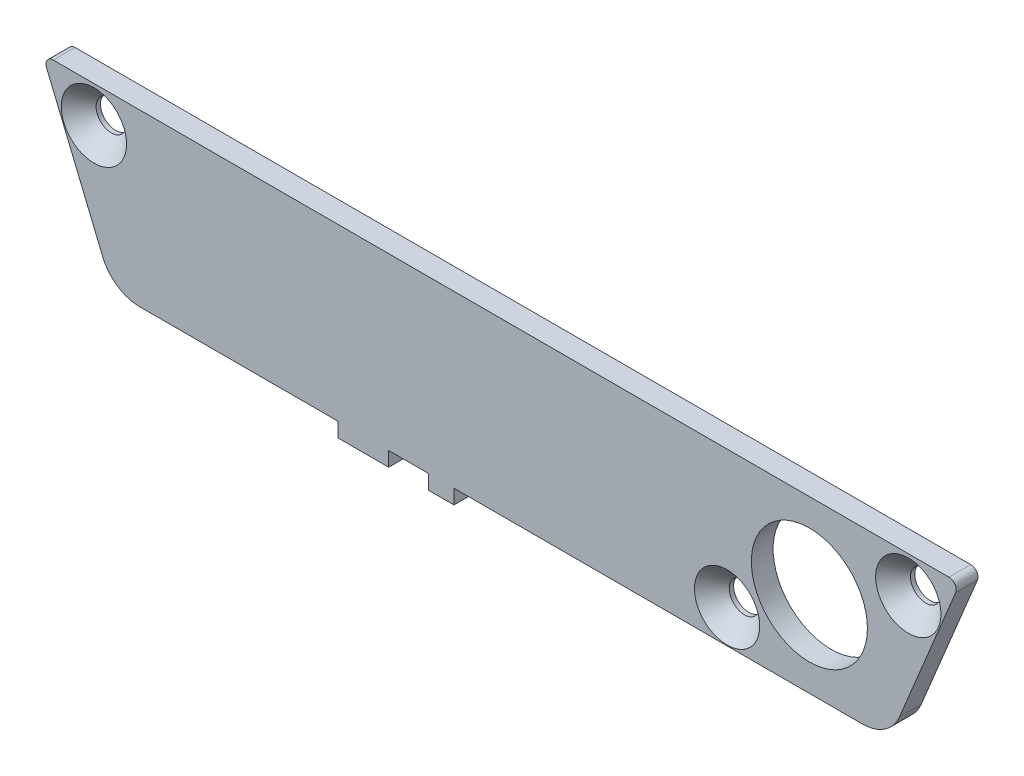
ISO-10303-21;
HEADER;
FILE_DESCRIPTION(('STEP AP214'),'2;1');
FILE_NAME('part.step','',(''),(''),'','','');
FILE_SCHEMA(('AUTOMOTIVE_DESIGN { 1 0 10303 214 1 1 1 1 }'));
ENDSEC;
DATA;
#1=APPLICATION_CONTEXT('core data for automotive mechanical design processes');
#2=APPLICATION_PROTOCOL_DEFINITION('international standard','automotive_design',2000,#1);
#3=PRODUCT_CONTEXT('',#1,'mechanical');
#4=PRODUCT('Part','Part','',(#3));
#5=PRODUCT_RELATED_PRODUCT_CATEGORY('part','',(#4));
#6=PRODUCT_DEFINITION_FORMATION('','',#4);
#7=PRODUCT_DEFINITION_CONTEXT('part definition',#1,'design');
#8=PRODUCT_DEFINITION('design','',#6,#7);
#9=PRODUCT_DEFINITION_SHAPE('','',#8);
#10=(LENGTH_UNIT() NAMED_UNIT(*) SI_UNIT(.MILLI.,.METRE.));
#11=(NAMED_UNIT(*) PLANE_ANGLE_UNIT() SI_UNIT($,.RADIAN.));
#12=(NAMED_UNIT(*) SI_UNIT($,.STERADIAN.) SOLID_ANGLE_UNIT());
#13=UNCERTAINTY_MEASURE_WITH_UNIT(LENGTH_MEASURE(1.E-05),#10,'distance_accuracy_value','');
#14=(GEOMETRIC_REPRESENTATION_CONTEXT(3) GLOBAL_UNCERTAINTY_ASSIGNED_CONTEXT((#13)) GLOBAL_UNIT_ASSIGNED_CONTEXT((#10,
#11,#12)) REPRESENTATION_CONTEXT('',''));
#15=CARTESIAN_POINT('',(0.,0.,0.));
#16=DIRECTION('',(0.,0.,1.));
#17=DIRECTION('',(1.,0.,0.));
#18=AXIS2_PLACEMENT_3D('',#15,#16,#17);
#19=CARTESIAN_POINT('',(130.529448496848,75.83614955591,131.349627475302));
#20=DIRECTION('',(0.,0.,1.));
#21=DIRECTION('',(1.,0.,0.));
#22=AXIS2_PLACEMENT_3D('',#19,#20,#21);
#23=CYLINDRICAL_SURFACE('',#22,0.999999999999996);
#24=CARTESIAN_POINT('',(130.529448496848,75.83614955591,134.349627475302));
#25=DIRECTION('',(0.,0.,1.));
#26=DIRECTION('',(1.,0.,0.));
#27=AXIS2_PLACEMENT_3D('',#24,#25,#26);
#28=CIRCLE('',#27,0.999999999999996);
#29=CARTESIAN_POINT('',(131.45332802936,75.4534661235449,134.349627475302));
#30=VERTEX_POINT('',#29);
#31=CARTESIAN_POINT('',(130.529448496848,76.83614955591,134.349627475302));
#32=VERTEX_POINT('',#31);
#33=EDGE_CURVE('E177',#30,#32,#28,.T.);
#34=ORIENTED_EDGE('',*,*,#33,.F.);
#35=DIRECTION('',(0.,0.,1.));
#36=VECTOR('',#35,1.);
#37=CARTESIAN_POINT('',(131.45332802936,75.4534661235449,131.349627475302));
#38=LINE('',#37,#36);
#39=CARTESIAN_POINT('',(131.45332802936,75.4534661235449,131.349627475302));
#40=VERTEX_POINT('',#39);
#41=EDGE_CURVE('E11',#40,#30,#38,.T.);
#42=ORIENTED_EDGE('',*,*,#41,.F.);
#43=CARTESIAN_POINT('',(130.529448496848,75.83614955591,131.349627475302));
#44=DIRECTION('',(0.,0.,1.));
#45=DIRECTION('',(1.,0.,0.));
#46=AXIS2_PLACEMENT_3D('',#43,#44,#45);
#47=CIRCLE('',#46,0.999999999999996);
#48=CARTESIAN_POINT('',(130.529448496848,76.83614955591,131.349627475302));
#49=VERTEX_POINT('',#48);
#50=EDGE_CURVE('E222',#40,#49,#47,.T.);
#51=ORIENTED_EDGE('',*,*,#50,.T.);
#52=DIRECTION('',(0.,0.,1.));
#53=VECTOR('',#52,1.);
#54=CARTESIAN_POINT('',(130.529448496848,76.83614955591,131.349627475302));
#55=LINE('',#54,#53);
#56=EDGE_CURVE('E35',#49,#32,#55,.T.);
#57=ORIENTED_EDGE('',*,*,#56,.T.);
#58=EDGE_LOOP('',(#34,#42,#51,#57));
#59=FACE_BOUND('',#58,.T.);
#60=ADVANCED_FACE('F32',(#59),#23,.T.);
#61=CARTESIAN_POINT('',(123.698390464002,56.7313906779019,131.349627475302));
#62=DIRECTION('',(0.923879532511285,-0.382683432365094,0.));
#63=DIRECTION('',(0.382683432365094,0.923879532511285,0.));
#64=AXIS2_PLACEMENT_3D('',#61,#62,#63);
#65=PLANE('',#64);
#66=DIRECTION('',(0.382683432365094,0.923879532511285,0.));
#67=VECTOR('',#66,1.);
#68=CARTESIAN_POINT('',(123.698390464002,56.7313906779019,134.349627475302));
#69=LINE('',#68,#67);
#70=CARTESIAN_POINT('',(123.698390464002,56.7313906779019,134.349627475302));
#71=VERTEX_POINT('',#70);
#72=EDGE_CURVE('E220',#71,#30,#69,.T.);
#73=ORIENTED_EDGE('',*,*,#72,.F.);
#74=DIRECTION('',(0.,0.,1.));
#75=VECTOR('',#74,1.);
#76=CARTESIAN_POINT('',(123.698390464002,56.7313906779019,131.349627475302));
#77=LINE('',#76,#75);
#78=CARTESIAN_POINT('',(123.698390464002,56.7313906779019,131.349627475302));
#79=VERTEX_POINT('',#78);
#80=EDGE_CURVE('E41',#79,#71,#77,.T.);
#81=ORIENTED_EDGE('',*,*,#80,.F.);
#82=DIRECTION('',(0.382683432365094,0.923879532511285,0.));
#83=VECTOR('',#82,1.);
#84=CARTESIAN_POINT('',(123.698390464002,56.7313906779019,131.349627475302));
#85=LINE('',#84,#83);
#86=EDGE_CURVE('E167',#79,#40,#85,.T.);
#87=ORIENTED_EDGE('',*,*,#86,.T.);
#88=ORIENTED_EDGE('',*,*,#41,.T.);
#89=EDGE_LOOP('',(#73,#81,#87,#88));
#90=FACE_BOUND('',#89,.T.);
#91=ADVANCED_FACE('F251',(#90),#65,.T.);
#92=CARTESIAN_POINT('',(118.61705303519,58.8361495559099,131.349627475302));
#93=DIRECTION('',(0.,0.,1.));
#94=DIRECTION('',(1.,0.,0.));
#95=AXIS2_PLACEMENT_3D('',#92,#93,#94);
#96=CYLINDRICAL_SURFACE('',#95,5.49999999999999);
#97=CARTESIAN_POINT('',(118.61705303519,58.8361495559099,134.349627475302));
#98=DIRECTION('',(0.,0.,1.));
#99=DIRECTION('',(1.,0.,0.));
#100=AXIS2_PLACEMENT_3D('',#97,#98,#99);
#101=CIRCLE('',#100,5.49999999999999);
#102=CARTESIAN_POINT('',(118.61705303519,53.33614955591,134.349627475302));
#103=VERTEX_POINT('',#102);
#104=EDGE_CURVE('E154',#103,#71,#101,.T.);
#105=ORIENTED_EDGE('',*,*,#104,.F.);
#106=DIRECTION('',(0.,0.,1.));
#107=VECTOR('',#106,1.);
#108=CARTESIAN_POINT('',(118.61705303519,53.33614955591,131.349627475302));
#109=LINE('',#108,#107);
#110=CARTESIAN_POINT('',(118.61705303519,53.33614955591,131.349627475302));
#111=VERTEX_POINT('',#110);
#112=EDGE_CURVE('E149',#111,#103,#109,.T.);
#113=ORIENTED_EDGE('',*,*,#112,.F.);
#114=CARTESIAN_POINT('',(118.61705303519,58.8361495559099,131.349627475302));
#115=DIRECTION('',(0.,0.,1.));
#116=DIRECTION('',(1.,0.,0.));
#117=AXIS2_PLACEMENT_3D('',#114,#115,#116);
#118=CIRCLE('',#117,5.49999999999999);
#119=EDGE_CURVE('E152',#111,#79,#118,.T.);
#120=ORIENTED_EDGE('',*,*,#119,.T.);
#121=ORIENTED_EDGE('',*,*,#80,.T.);
#122=EDGE_LOOP('',(#105,#113,#120,#121));
#123=FACE_BOUND('',#122,.T.);
#124=ADVANCED_FACE('F151',(#123),#96,.T.);
#125=CARTESIAN_POINT('',(62.2839844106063,53.33614955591,131.349627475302));
#126=DIRECTION('',(0.,-1.,0.));
#127=DIRECTION('',(0.,0.,-1.));
#128=AXIS2_PLACEMENT_3D('',#125,#126,#127);
#129=PLANE('',#128);
#130=DIRECTION('',(1.,0.,0.));
#131=VECTOR('',#130,1.);
#132=CARTESIAN_POINT('',(62.2839844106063,53.33614955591,134.349627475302));
#133=LINE('',#132,#131);
#134=CARTESIAN_POINT('',(62.2839844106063,53.33614955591,134.349627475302));
#135=VERTEX_POINT('',#134);
#136=EDGE_CURVE('E217',#135,#103,#133,.T.);
#137=ORIENTED_EDGE('',*,*,#136,.F.);
#138=DIRECTION('',(0.,0.,1.));
#139=VECTOR('',#138,1.);
#140=CARTESIAN_POINT('',(62.2839844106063,53.33614955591,131.349627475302));
#141=LINE('',#140,#139);
#142=CARTESIAN_POINT('',(62.2839844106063,53.33614955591,131.349627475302));
#143=VERTEX_POINT('',#142);
#144=EDGE_CURVE('E159',#143,#135,#141,.T.);
#145=ORIENTED_EDGE('',*,*,#144,.F.);
#146=DIRECTION('',(1.,0.,0.));
#147=VECTOR('',#146,1.);
#148=CARTESIAN_POINT('',(62.2839844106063,53.33614955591,131.349627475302));
#149=LINE('',#148,#147);
#150=EDGE_CURVE('E165',#143,#111,#149,.T.);
#151=ORIENTED_EDGE('',*,*,#150,.T.);
#152=ORIENTED_EDGE('',*,*,#112,.T.);
#153=EDGE_LOOP('',(#137,#145,#151,#152));
#154=FACE_BOUND('',#153,.T.);
#155=ADVANCED_FACE('F169',(#154),#129,.T.);
#156=CARTESIAN_POINT('',(62.2839844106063,53.33614955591,131.349627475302));
#157=DIRECTION('',(1.,0.,0.));
#158=DIRECTION('',(0.,0.,-1.));
#159=AXIS2_PLACEMENT_3D('',#156,#157,#158);
#160=PLANE('',#159);
#161=DIRECTION('',(0.,1.,0.));
#162=VECTOR('',#161,1.);
#163=CARTESIAN_POINT('',(62.2839844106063,53.33614955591,134.349627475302));
#164=LINE('',#163,#162);
#165=CARTESIAN_POINT('',(62.2839844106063,51.33614955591,134.349627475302));
#166=VERTEX_POINT('',#165);
#167=EDGE_CURVE('E214',#166,#135,#164,.T.);
#168=ORIENTED_EDGE('',*,*,#167,.F.);
#169=DIRECTION('',(0.,0.,1.));
#170=VECTOR('',#169,1.);
#171=CARTESIAN_POINT('',(62.2839844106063,51.33614955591,131.349627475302));
#172=LINE('',#171,#170);
#173=CARTESIAN_POINT('',(62.2839844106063,51.33614955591,131.349627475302));
#174=VERTEX_POINT('',#173);
#175=EDGE_CURVE('E226',#174,#166,#172,.T.);
#176=ORIENTED_EDGE('',*,*,#175,.F.);
#177=DIRECTION('',(0.,1.,0.));
#178=VECTOR('',#177,1.);
#179=CARTESIAN_POINT('',(62.2839844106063,53.33614955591,131.349627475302));
#180=LINE('',#179,#178);
#181=EDGE_CURVE('E170',#174,#143,#180,.T.);
#182=ORIENTED_EDGE('',*,*,#181,.T.);
#183=ORIENTED_EDGE('',*,*,#144,.T.);
#184=EDGE_LOOP('',(#168,#176,#182,#183));
#185=FACE_BOUND('',#184,.T.);
#186=ADVANCED_FACE('F264',(#185),#160,.T.);
#187=CARTESIAN_POINT('',(58.7839844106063,51.33614955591,131.349627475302));
#188=DIRECTION('',(0.,-1.,0.));
#189=DIRECTION('',(0.,0.,-1.));
#190=AXIS2_PLACEMENT_3D('',#187,#188,#189);
#191=PLANE('',#190);
#192=DIRECTION('',(1.,0.,0.));
#193=VECTOR('',#192,1.);
#194=CARTESIAN_POINT('',(58.7839844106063,51.33614955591,134.349627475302));
#195=LINE('',#194,#193);
#196=CARTESIAN_POINT('',(58.7839844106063,51.33614955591,134.349627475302));
#197=VERTEX_POINT('',#196);
#198=EDGE_CURVE('E211',#197,#166,#195,.T.);
#199=ORIENTED_EDGE('',*,*,#198,.F.);
#200=DIRECTION('',(0.,0.,1.));
#201=VECTOR('',#200,1.);
#202=CARTESIAN_POINT('',(58.7839844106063,51.33614955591,131.349627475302));
#203=LINE('',#202,#201);
#204=CARTESIAN_POINT('',(58.7839844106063,51.33614955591,131.349627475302));
#205=VERTEX_POINT('',#204);
#206=EDGE_CURVE('E228',#205,#197,#203,.T.);
#207=ORIENTED_EDGE('',*,*,#206,.F.);
#208=DIRECTION('',(1.,0.,0.));
#209=VECTOR('',#208,1.);
#210=CARTESIAN_POINT('',(58.7839844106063,51.33614955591,131.349627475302));
#211=LINE('',#210,#209);
#212=EDGE_CURVE('E172',#205,#174,#211,.T.);
#213=ORIENTED_EDGE('',*,*,#212,.T.);
#214=ORIENTED_EDGE('',*,*,#175,.T.);
#215=EDGE_LOOP('',(#199,#207,#213,#214));
#216=FACE_BOUND('',#215,.T.);
#217=ADVANCED_FACE('F267',(#216),#191,.T.);
#218=CARTESIAN_POINT('',(58.7839844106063,53.33614955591,131.349627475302));
#219=DIRECTION('',(-1.,0.,0.));
#220=DIRECTION('',(0.,-1.,0.));
#221=AXIS2_PLACEMENT_3D('',#218,#219,#220);
#222=PLANE('',#221);
#223=DIRECTION('',(0.,-1.,0.));
#224=VECTOR('',#223,1.);
#225=CARTESIAN_POINT('',(58.7839844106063,53.33614955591,134.349627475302));
#226=LINE('',#225,#224);
#227=CARTESIAN_POINT('',(58.7839844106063,53.33614955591,134.349627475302));
#228=VERTEX_POINT('',#227);
#229=EDGE_CURVE('E208',#228,#197,#226,.T.);
#230=ORIENTED_EDGE('',*,*,#229,.F.);
#231=DIRECTION('',(0.,0.,1.));
#232=VECTOR('',#231,1.);
#233=CARTESIAN_POINT('',(58.7839844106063,53.33614955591,131.349627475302));
#234=LINE('',#233,#232);
#235=CARTESIAN_POINT('',(58.7839844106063,53.33614955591,131.349627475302));
#236=VERTEX_POINT('',#235);
#237=EDGE_CURVE('E230',#236,#228,#234,.T.);
#238=ORIENTED_EDGE('',*,*,#237,.F.);
#239=DIRECTION('',(0.,-1.,0.));
#240=VECTOR('',#239,1.);
#241=CARTESIAN_POINT('',(58.7839844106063,53.33614955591,131.349627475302));
#242=LINE('',#241,#240);
#243=EDGE_CURVE('E409',#236,#205,#242,.T.);
#244=ORIENTED_EDGE('',*,*,#243,.T.);
#245=ORIENTED_EDGE('',*,*,#206,.T.);
#246=EDGE_LOOP('',(#230,#238,#244,#245));
#247=FACE_BOUND('',#246,.T.);
#248=ADVANCED_FACE('F271',(#247),#222,.T.);
#249=CARTESIAN_POINT('',(53.2839844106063,53.33614955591,131.349627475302));
#250=DIRECTION('',(0.,-1.,0.));
#251=DIRECTION('',(0.,0.,-1.));
#252=AXIS2_PLACEMENT_3D('',#249,#250,#251);
#253=PLANE('',#252);
#254=DIRECTION('',(1.,0.,0.));
#255=VECTOR('',#254,1.);
#256=CARTESIAN_POINT('',(53.2839844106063,53.33614955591,134.349627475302));
#257=LINE('',#256,#255);
#258=CARTESIAN_POINT('',(53.2839844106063,53.33614955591,134.349627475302));
#259=VERTEX_POINT('',#258);
#260=EDGE_CURVE('E205',#259,#228,#257,.T.);
#261=ORIENTED_EDGE('',*,*,#260,.F.);
#262=DIRECTION('',(0.,0.,1.));
#263=VECTOR('',#262,1.);
#264=CARTESIAN_POINT('',(53.2839844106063,53.33614955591,131.349627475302));
#265=LINE('',#264,#263);
#266=CARTESIAN_POINT('',(53.2839844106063,53.33614955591,131.349627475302));
#267=VERTEX_POINT('',#266);
#268=EDGE_CURVE('E232',#267,#259,#265,.T.);
#269=ORIENTED_EDGE('',*,*,#268,.F.);
#270=DIRECTION('',(1.,0.,0.));
#271=VECTOR('',#270,1.);
#272=CARTESIAN_POINT('',(53.2839844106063,53.33614955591,131.349627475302));
#273=LINE('',#272,#271);
#274=EDGE_CURVE('E406',#267,#236,#273,.T.);
#275=ORIENTED_EDGE('',*,*,#274,.T.);
#276=ORIENTED_EDGE('',*,*,#237,.T.);
#277=EDGE_LOOP('',(#261,#269,#275,#276));
#278=FACE_BOUND('',#277,.T.);
#279=ADVANCED_FACE('F275',(#278),#253,.T.);
#280=CARTESIAN_POINT('',(53.2839844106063,51.33614955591,131.349627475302));
#281=DIRECTION('',(1.,0.,0.));
#282=DIRECTION('',(0.,0.,-1.));
#283=AXIS2_PLACEMENT_3D('',#280,#281,#282);
#284=PLANE('',#283);
#285=DIRECTION('',(0.,1.,0.));
#286=VECTOR('',#285,1.);
#287=CARTESIAN_POINT('',(53.2839844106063,51.33614955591,134.349627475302));
#288=LINE('',#287,#286);
#289=CARTESIAN_POINT('',(53.2839844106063,51.33614955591,134.349627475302));
#290=VERTEX_POINT('',#289);
#291=EDGE_CURVE('E202',#290,#259,#288,.T.);
#292=ORIENTED_EDGE('',*,*,#291,.F.);
#293=DIRECTION('',(0.,0.,1.));
#294=VECTOR('',#293,1.);
#295=CARTESIAN_POINT('',(53.2839844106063,51.33614955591,131.349627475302));
#296=LINE('',#295,#294);
#297=CARTESIAN_POINT('',(53.2839844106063,51.33614955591,131.349627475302));
#298=VERTEX_POINT('',#297);
#299=EDGE_CURVE('E234',#298,#290,#296,.T.);
#300=ORIENTED_EDGE('',*,*,#299,.F.);
#301=DIRECTION('',(0.,1.,0.));
#302=VECTOR('',#301,1.);
#303=CARTESIAN_POINT('',(53.2839844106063,51.33614955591,131.349627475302));
#304=LINE('',#303,#302);
#305=EDGE_CURVE('E403',#298,#267,#304,.T.);
#306=ORIENTED_EDGE('',*,*,#305,.T.);
#307=ORIENTED_EDGE('',*,*,#268,.T.);
#308=EDGE_LOOP('',(#292,#300,#306,#307));
#309=FACE_BOUND('',#308,.T.);
#310=ADVANCED_FACE('F279',(#309),#284,.T.);
#311=CARTESIAN_POINT('',(46.2839844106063,51.33614955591,131.349627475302));
#312=DIRECTION('',(0.,-1.,0.));
#313=DIRECTION('',(0.,0.,-1.));
#314=AXIS2_PLACEMENT_3D('',#311,#312,#313);
#315=PLANE('',#314);
#316=DIRECTION('',(1.,0.,0.));
#317=VECTOR('',#316,1.);
#318=CARTESIAN_POINT('',(46.2839844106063,51.33614955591,134.349627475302));
#319=LINE('',#318,#317);
#320=CARTESIAN_POINT('',(46.2839844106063,51.33614955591,134.349627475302));
#321=VERTEX_POINT('',#320);
#322=EDGE_CURVE('E199',#321,#290,#319,.T.);
#323=ORIENTED_EDGE('',*,*,#322,.F.);
#324=DIRECTION('',(0.,0.,1.));
#325=VECTOR('',#324,1.);
#326=CARTESIAN_POINT('',(46.2839844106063,51.33614955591,131.349627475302));
#327=LINE('',#326,#325);
#328=CARTESIAN_POINT('',(46.2839844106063,51.33614955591,131.349627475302));
#329=VERTEX_POINT('',#328);
#330=EDGE_CURVE('E236',#329,#321,#327,.T.);
#331=ORIENTED_EDGE('',*,*,#330,.F.);
#332=DIRECTION('',(1.,0.,0.));
#333=VECTOR('',#332,1.);
#334=CARTESIAN_POINT('',(46.2839844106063,51.33614955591,131.349627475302));
#335=LINE('',#334,#333);
#336=EDGE_CURVE('E400',#329,#298,#335,.T.);
#337=ORIENTED_EDGE('',*,*,#336,.T.);
#338=ORIENTED_EDGE('',*,*,#299,.T.);
#339=EDGE_LOOP('',(#323,#331,#337,#338));
#340=FACE_BOUND('',#339,.T.);
#341=ADVANCED_FACE('F283',(#340),#315,.T.);
#342=CARTESIAN_POINT('',(46.2839844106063,53.33614955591,131.349627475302));
#343=DIRECTION('',(-1.,0.,0.));
#344=DIRECTION('',(0.,0.,1.));
#345=AXIS2_PLACEMENT_3D('',#342,#343,#344);
#346=PLANE('',#345);
#347=DIRECTION('',(0.,-1.,0.));
#348=VECTOR('',#347,1.);
#349=CARTESIAN_POINT('',(46.2839844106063,53.33614955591,134.349627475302));
#350=LINE('',#349,#348);
#351=CARTESIAN_POINT('',(46.2839844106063,53.33614955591,134.349627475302));
#352=VERTEX_POINT('',#351);
#353=EDGE_CURVE('E196',#352,#321,#350,.T.);
#354=ORIENTED_EDGE('',*,*,#353,.F.);
#355=DIRECTION('',(0.,0.,1.));
#356=VECTOR('',#355,1.);
#357=CARTESIAN_POINT('',(46.2839844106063,53.33614955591,131.349627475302));
#358=LINE('',#357,#356);
#359=CARTESIAN_POINT('',(46.2839844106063,53.33614955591,131.349627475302));
#360=VERTEX_POINT('',#359);
#361=EDGE_CURVE('E238',#360,#352,#358,.T.);
#362=ORIENTED_EDGE('',*,*,#361,.F.);
#363=DIRECTION('',(0.,-1.,0.));
#364=VECTOR('',#363,1.);
#365=CARTESIAN_POINT('',(46.2839844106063,53.33614955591,131.349627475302));
#366=LINE('',#365,#364);
#367=EDGE_CURVE('E397',#360,#329,#366,.T.);
#368=ORIENTED_EDGE('',*,*,#367,.T.);
#369=ORIENTED_EDGE('',*,*,#330,.T.);
#370=EDGE_LOOP('',(#354,#362,#368,#369));
#371=FACE_BOUND('',#370,.T.);
#372=ADVANCED_FACE('F287',(#371),#346,.T.);
#373=CARTESIAN_POINT('',(18.9509157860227,53.33614955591,131.349627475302));
#374=DIRECTION('',(0.,-1.,0.));
#375=DIRECTION('',(0.,0.,-1.));
#376=AXIS2_PLACEMENT_3D('',#373,#374,#375);
#377=PLANE('',#376);
#378=DIRECTION('',(1.,0.,0.));
#379=VECTOR('',#378,1.);
#380=CARTESIAN_POINT('',(18.9509157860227,53.33614955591,134.349627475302));
#381=LINE('',#380,#379);
#382=CARTESIAN_POINT('',(18.9509157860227,53.33614955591,134.349627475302));
#383=VERTEX_POINT('',#382);
#384=EDGE_CURVE('E193',#383,#352,#381,.T.);
#385=ORIENTED_EDGE('',*,*,#384,.F.);
#386=DIRECTION('',(0.,0.,1.));
#387=VECTOR('',#386,1.);
#388=CARTESIAN_POINT('',(18.9509157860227,53.33614955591,131.349627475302));
#389=LINE('',#388,#387);
#390=CARTESIAN_POINT('',(18.9509157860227,53.33614955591,131.349627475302));
#391=VERTEX_POINT('',#390);
#392=EDGE_CURVE('E240',#391,#383,#389,.T.);
#393=ORIENTED_EDGE('',*,*,#392,.F.);
#394=DIRECTION('',(1.,0.,0.));
#395=VECTOR('',#394,1.);
#396=CARTESIAN_POINT('',(18.9509157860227,53.33614955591,131.349627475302));
#397=LINE('',#396,#395);
#398=EDGE_CURVE('E394',#391,#360,#397,.T.);
#399=ORIENTED_EDGE('',*,*,#398,.T.);
#400=ORIENTED_EDGE('',*,*,#361,.T.);
#401=EDGE_LOOP('',(#385,#393,#399,#400));
#402=FACE_BOUND('',#401,.T.);
#403=ADVANCED_FACE('F291',(#402),#377,.T.);
#404=CARTESIAN_POINT('',(18.9509157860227,58.8361495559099,131.349627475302));
#405=DIRECTION('',(0.,0.,1.));
#406=DIRECTION('',(1.,0.,0.));
#407=AXIS2_PLACEMENT_3D('',#404,#405,#406);
#408=CYLINDRICAL_SURFACE('',#407,5.49999999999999);
#409=CARTESIAN_POINT('',(18.9509157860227,58.8361495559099,134.349627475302));
#410=DIRECTION('',(0.,0.,1.));
#411=DIRECTION('',(1.,0.,0.));
#412=AXIS2_PLACEMENT_3D('',#409,#410,#411);
#413=CIRCLE('',#412,5.49999999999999);
#414=CARTESIAN_POINT('',(13.8695783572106,56.7313906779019,134.349627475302));
#415=VERTEX_POINT('',#414);
#416=EDGE_CURVE('E190',#415,#383,#413,.T.);
#417=ORIENTED_EDGE('',*,*,#416,.F.);
#418=DIRECTION('',(0.,0.,1.));
#419=VECTOR('',#418,1.);
#420=CARTESIAN_POINT('',(13.8695783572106,56.7313906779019,131.349627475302));
#421=LINE('',#420,#419);
#422=CARTESIAN_POINT('',(13.8695783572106,56.7313906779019,131.349627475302));
#423=VERTEX_POINT('',#422);
#424=EDGE_CURVE('E242',#423,#415,#421,.T.);
#425=ORIENTED_EDGE('',*,*,#424,.F.);
#426=CARTESIAN_POINT('',(18.9509157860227,58.8361495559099,131.349627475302));
#427=DIRECTION('',(0.,0.,1.));
#428=DIRECTION('',(1.,0.,0.));
#429=AXIS2_PLACEMENT_3D('',#426,#427,#428);
#430=CIRCLE('',#429,5.49999999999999);
#431=EDGE_CURVE('E392',#423,#391,#430,.T.);
#432=ORIENTED_EDGE('',*,*,#431,.T.);
#433=ORIENTED_EDGE('',*,*,#392,.T.);
#434=EDGE_LOOP('',(#417,#425,#432,#433));
#435=FACE_BOUND('',#434,.T.);
#436=ADVANCED_FACE('F295',(#435),#408,.T.);
#437=CARTESIAN_POINT('',(6.11464079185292,75.4534661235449,131.349627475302));
#438=DIRECTION('',(-0.923879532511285,-0.382683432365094,0.));
#439=DIRECTION('',(0.382683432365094,-0.923879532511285,0.));
#440=AXIS2_PLACEMENT_3D('',#437,#438,#439);
#441=PLANE('',#440);
#442=DIRECTION('',(0.382683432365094,-0.923879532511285,0.));
#443=VECTOR('',#442,1.);
#444=CARTESIAN_POINT('',(6.11464079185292,75.4534661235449,134.349627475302));
#445=LINE('',#444,#443);
#446=CARTESIAN_POINT('',(6.11464079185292,75.4534661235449,134.349627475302));
#447=VERTEX_POINT('',#446);
#448=EDGE_CURVE('E187',#447,#415,#445,.T.);
#449=ORIENTED_EDGE('',*,*,#448,.F.);
#450=DIRECTION('',(0.,0.,1.));
#451=VECTOR('',#450,1.);
#452=CARTESIAN_POINT('',(6.11464079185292,75.4534661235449,131.349627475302));
#453=LINE('',#452,#451);
#454=CARTESIAN_POINT('',(6.11464079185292,75.4534661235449,131.349627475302));
#455=VERTEX_POINT('',#454);
#456=EDGE_CURVE('E245',#455,#447,#453,.T.);
#457=ORIENTED_EDGE('',*,*,#456,.F.);
#458=DIRECTION('',(0.382683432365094,-0.923879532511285,0.));
#459=VECTOR('',#458,1.);
#460=CARTESIAN_POINT('',(6.11464079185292,75.4534661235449,131.349627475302));
#461=LINE('',#460,#459);
#462=EDGE_CURVE('E389',#455,#423,#461,.T.);
#463=ORIENTED_EDGE('',*,*,#462,.T.);
#464=ORIENTED_EDGE('',*,*,#424,.T.);
#465=EDGE_LOOP('',(#449,#457,#463,#464));
#466=FACE_BOUND('',#465,.T.);
#467=ADVANCED_FACE('F299',(#466),#441,.T.);
#468=CARTESIAN_POINT('',(7.03852032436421,75.83614955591,131.349627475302));
#469=DIRECTION('',(0.,0.,1.));
#470=DIRECTION('',(1.,0.,0.));
#471=AXIS2_PLACEMENT_3D('',#468,#469,#470);
#472=CYLINDRICAL_SURFACE('',#471,1.);
#473=CARTESIAN_POINT('',(7.03852032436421,75.83614955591,134.349627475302));
#474=DIRECTION('',(0.,0.,1.));
#475=DIRECTION('',(1.,0.,0.));
#476=AXIS2_PLACEMENT_3D('',#473,#474,#475);
#477=CIRCLE('',#476,1.);
#478=CARTESIAN_POINT('',(7.03852032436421,76.83614955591,134.349627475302));
#479=VERTEX_POINT('',#478);
#480=EDGE_CURVE('E184',#479,#447,#477,.T.);
#481=ORIENTED_EDGE('',*,*,#480,.F.);
#482=DIRECTION('',(0.,0.,1.));
#483=VECTOR('',#482,1.);
#484=CARTESIAN_POINT('',(7.03852032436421,76.83614955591,131.349627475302));
#485=LINE('',#484,#483);
#486=CARTESIAN_POINT('',(7.03852032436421,76.83614955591,131.349627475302));
#487=VERTEX_POINT('',#486);
#488=EDGE_CURVE('E246',#487,#479,#485,.T.);
#489=ORIENTED_EDGE('',*,*,#488,.F.);
#490=CARTESIAN_POINT('',(7.03852032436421,75.83614955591,131.349627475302));
#491=DIRECTION('',(0.,0.,1.));
#492=DIRECTION('',(1.,0.,0.));
#493=AXIS2_PLACEMENT_3D('',#490,#491,#492);
#494=CIRCLE('',#493,1.);
#495=EDGE_CURVE('E386',#487,#455,#494,.T.);
#496=ORIENTED_EDGE('',*,*,#495,.T.);
#497=ORIENTED_EDGE('',*,*,#456,.T.);
#498=EDGE_LOOP('',(#481,#489,#496,#497));
#499=FACE_BOUND('',#498,.T.);
#500=ADVANCED_FACE('F303',(#499),#472,.T.);
#501=CARTESIAN_POINT('',(130.529448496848,76.83614955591,131.349627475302));
#502=DIRECTION('',(0.,1.,0.));
#503=DIRECTION('',(0.,0.,1.));
#504=AXIS2_PLACEMENT_3D('',#501,#502,#503);
#505=PLANE('',#504);
#506=DIRECTION('',(-1.,0.,0.));
#507=VECTOR('',#506,1.);
#508=CARTESIAN_POINT('',(130.529448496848,76.83614955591,134.349627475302));
#509=LINE('',#508,#507);
#510=EDGE_CURVE('E180',#32,#479,#509,.T.);
#511=ORIENTED_EDGE('',*,*,#510,.F.);
#512=ORIENTED_EDGE('',*,*,#56,.F.);
#513=DIRECTION('',(-1.,0.,0.));
#514=VECTOR('',#513,1.);
#515=CARTESIAN_POINT('',(130.529448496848,76.83614955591,131.349627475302));
#516=LINE('',#515,#514);
#517=EDGE_CURVE('E384',#49,#487,#516,.T.);
#518=ORIENTED_EDGE('',*,*,#517,.T.);
#519=ORIENTED_EDGE('',*,*,#488,.T.);
#520=EDGE_LOOP('',(#511,#512,#518,#519));
#521=FACE_BOUND('',#520,.T.);
#522=ADVANCED_FACE('F248',(#521),#505,.T.);
#523=CARTESIAN_POINT('',(130.529448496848,75.83614955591,131.349627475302));
#524=DIRECTION('',(0.,0.,1.));
#525=DIRECTION('',(1.,0.,0.));
#526=AXIS2_PLACEMENT_3D('',#523,#524,#525);
#527=PLANE('',#526);
#528=CARTESIAN_POINT('',(111.283984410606,65.08614955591,131.349627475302));
#529=DIRECTION('',(0.,0.,1.));
#530=DIRECTION('',(1.,0.,0.));
#531=AXIS2_PLACEMENT_3D('',#528,#529,#530);
#532=CIRCLE('',#531,8.00000000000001);
#533=CARTESIAN_POINT('',(119.283984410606,65.08614955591,131.349627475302));
#534=VERTEX_POINT('',#533);
#535=EDGE_CURVE('E353',#534,#534,#532,.F.);
#536=ORIENTED_EDGE('',*,*,#535,.F.);
#537=EDGE_LOOP('',(#536));
#538=FACE_BOUND('',#537,.T.);
#539=CARTESIAN_POINT('',(12.6461061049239,71.8361495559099,131.349627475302));
#540=DIRECTION('',(0.,0.,1.));
#541=DIRECTION('',(1.,0.,0.));
#542=AXIS2_PLACEMENT_3D('',#539,#540,#541);
#543=CIRCLE('',#542,2.1);
#544=CARTESIAN_POINT('',(14.7461061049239,71.8361495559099,131.349627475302));
#545=VERTEX_POINT('',#544);
#546=EDGE_CURVE('E363',#545,#545,#543,.T.);
#547=ORIENTED_EDGE('',*,*,#546,.T.);
#548=EDGE_LOOP('',(#547));
#549=FACE_BOUND('',#548,.T.);
#550=CARTESIAN_POINT('',(99.9339844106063,57.93614955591,131.349627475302));
#551=DIRECTION('',(0.,0.,1.));
#552=DIRECTION('',(1.,0.,0.));
#553=AXIS2_PLACEMENT_3D('',#550,#551,#552);
#554=CIRCLE('',#553,2.1);
#555=CARTESIAN_POINT('',(102.033984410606,57.93614955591,131.349627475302));
#556=VERTEX_POINT('',#555);
#557=EDGE_CURVE('E372',#556,#556,#554,.T.);
#558=ORIENTED_EDGE('',*,*,#557,.T.);
#559=EDGE_LOOP('',(#558));
#560=FACE_BOUND('',#559,.T.);
#561=CARTESIAN_POINT('',(124.921862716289,71.8361495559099,131.349627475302));
#562=DIRECTION('',(0.,0.,1.));
#563=DIRECTION('',(1.,0.,0.));
#564=AXIS2_PLACEMENT_3D('',#561,#562,#563);
#565=CIRCLE('',#564,2.09999999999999);
#566=CARTESIAN_POINT('',(127.021862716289,71.8361495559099,131.349627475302));
#567=VERTEX_POINT('',#566);
#568=EDGE_CURVE('E181',#567,#567,#565,.T.);
#569=ORIENTED_EDGE('',*,*,#568,.T.);
#570=EDGE_LOOP('',(#569));
#571=FACE_BOUND('',#570,.T.);
#572=ORIENTED_EDGE('',*,*,#50,.F.);
#573=ORIENTED_EDGE('',*,*,#86,.F.);
#574=ORIENTED_EDGE('',*,*,#119,.F.);
#575=ORIENTED_EDGE('',*,*,#150,.F.);
#576=ORIENTED_EDGE('',*,*,#181,.F.);
#577=ORIENTED_EDGE('',*,*,#212,.F.);
#578=ORIENTED_EDGE('',*,*,#243,.F.);
#579=ORIENTED_EDGE('',*,*,#274,.F.);
#580=ORIENTED_EDGE('',*,*,#305,.F.);
#581=ORIENTED_EDGE('',*,*,#336,.F.);
#582=ORIENTED_EDGE('',*,*,#367,.F.);
#583=ORIENTED_EDGE('',*,*,#398,.F.);
#584=ORIENTED_EDGE('',*,*,#431,.F.);
#585=ORIENTED_EDGE('',*,*,#462,.F.);
#586=ORIENTED_EDGE('',*,*,#495,.F.);
#587=ORIENTED_EDGE('',*,*,#517,.F.);
#588=EDGE_LOOP('',(#572,#573,#574,#575,#576,#577,#578,#579,#580,#581,#582,#583,#584,#585,#586,#587));
#589=FACE_BOUND('',#588,.T.);
#590=ADVANCED_FACE('F163',(#538,#549,#560,#571,#589),#527,.F.);
#591=CARTESIAN_POINT('',(130.529448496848,75.83614955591,134.349627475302));
#592=DIRECTION('',(0.,0.,1.));
#593=DIRECTION('',(1.,0.,0.));
#594=AXIS2_PLACEMENT_3D('',#591,#592,#593);
#595=PLANE('',#594);
#596=CARTESIAN_POINT('',(111.283984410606,65.08614955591,134.349627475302));
#597=DIRECTION('',(0.,0.,1.));
#598=DIRECTION('',(1.,0.,0.));
#599=AXIS2_PLACEMENT_3D('',#596,#597,#598);
#600=CIRCLE('',#599,8.00000000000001);
#601=CARTESIAN_POINT('',(119.283984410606,65.08614955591,134.349627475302));
#602=VERTEX_POINT('',#601);
#603=EDGE_CURVE('E351',#602,#602,#600,.T.);
#604=ORIENTED_EDGE('',*,*,#603,.F.);
#605=EDGE_LOOP('',(#604));
#606=FACE_BOUND('',#605,.T.);
#607=CARTESIAN_POINT('',(12.6461061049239,71.8361495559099,134.349627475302));
#608=DIRECTION('',(0.,0.,1.));
#609=DIRECTION('',(1.,0.,0.));
#610=AXIS2_PLACEMENT_3D('',#607,#608,#609);
#611=CIRCLE('',#610,4.5);
#612=CARTESIAN_POINT('',(17.1461061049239,71.8361495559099,134.349627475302));
#613=VERTEX_POINT('',#612);
#614=EDGE_CURVE('E354',#613,#613,#611,.T.);
#615=ORIENTED_EDGE('',*,*,#614,.F.);
#616=EDGE_LOOP('',(#615));
#617=FACE_BOUND('',#616,.T.);
#618=CARTESIAN_POINT('',(99.9339844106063,57.93614955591,134.349627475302));
#619=DIRECTION('',(0.,0.,1.));
#620=DIRECTION('',(1.,0.,0.));
#621=AXIS2_PLACEMENT_3D('',#618,#619,#620);
#622=CIRCLE('',#621,4.5);
#623=CARTESIAN_POINT('',(104.433984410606,57.93614955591,134.349627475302));
#624=VERTEX_POINT('',#623);
#625=EDGE_CURVE('E366',#624,#624,#622,.T.);
#626=ORIENTED_EDGE('',*,*,#625,.F.);
#627=EDGE_LOOP('',(#626));
#628=FACE_BOUND('',#627,.T.);
#629=CARTESIAN_POINT('',(124.921862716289,71.8361495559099,134.349627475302));
#630=DIRECTION('',(0.,0.,1.));
#631=DIRECTION('',(1.,0.,0.));
#632=AXIS2_PLACEMENT_3D('',#629,#630,#631);
#633=CIRCLE('',#632,4.5);
#634=CARTESIAN_POINT('',(129.421862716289,71.8361495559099,134.349627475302));
#635=VERTEX_POINT('',#634);
#636=EDGE_CURVE('E375',#635,#635,#633,.T.);
#637=ORIENTED_EDGE('',*,*,#636,.F.);
#638=EDGE_LOOP('',(#637));
#639=FACE_BOUND('',#638,.T.);
#640=ORIENTED_EDGE('',*,*,#33,.T.);
#641=ORIENTED_EDGE('',*,*,#510,.T.);
#642=ORIENTED_EDGE('',*,*,#480,.T.);
#643=ORIENTED_EDGE('',*,*,#448,.T.);
#644=ORIENTED_EDGE('',*,*,#416,.T.);
#645=ORIENTED_EDGE('',*,*,#384,.T.);
#646=ORIENTED_EDGE('',*,*,#353,.T.);
#647=ORIENTED_EDGE('',*,*,#322,.T.);
#648=ORIENTED_EDGE('',*,*,#291,.T.);
#649=ORIENTED_EDGE('',*,*,#260,.T.);
#650=ORIENTED_EDGE('',*,*,#229,.T.);
#651=ORIENTED_EDGE('',*,*,#198,.T.);
#652=ORIENTED_EDGE('',*,*,#167,.T.);
#653=ORIENTED_EDGE('',*,*,#136,.T.);
#654=ORIENTED_EDGE('',*,*,#104,.T.);
#655=ORIENTED_EDGE('',*,*,#72,.T.);
#656=EDGE_LOOP('',(#640,#641,#642,#643,#644,#645,#646,#647,#648,#649,#650,#651,#652,#653,#654,#655));
#657=FACE_BOUND('',#656,.T.);
#658=ADVANCED_FACE('F250',(#606,#617,#628,#639,#657),#595,.T.);
#659=CARTESIAN_POINT('',(124.921862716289,71.8361495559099,134.349627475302));
#660=DIRECTION('',(0.,0.,1.));
#661=DIRECTION('',(1.,0.,0.));
#662=AXIS2_PLACEMENT_3D('',#659,#660,#661);
#663=CYLINDRICAL_SURFACE('',#662,2.09999999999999);
#664=ORIENTED_EDGE('',*,*,#568,.F.);
#665=EDGE_LOOP('',(#664));
#666=FACE_BOUND('',#665,.T.);
#667=CARTESIAN_POINT('',(124.921862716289,71.8361495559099,131.949627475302));
#668=DIRECTION('',(0.,0.,1.));
#669=DIRECTION('',(1.,0.,0.));
#670=AXIS2_PLACEMENT_3D('',#667,#668,#669);
#671=CIRCLE('',#670,2.09999999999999);
#672=CARTESIAN_POINT('',(127.021862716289,71.8361495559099,131.949627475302));
#673=VERTEX_POINT('',#672);
#674=EDGE_CURVE('E378',#673,#673,#671,.T.);
#675=ORIENTED_EDGE('',*,*,#674,.T.);
#676=EDGE_LOOP('',(#675));
#677=FACE_BOUND('',#676,.T.);
#678=ADVANCED_FACE('F315',(#666,#677),#663,.F.);
#679=CARTESIAN_POINT('',(124.921862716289,71.8361495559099,134.349627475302));
#680=DIRECTION('',(0.,0.,1.));
#681=DIRECTION('',(1.,0.,0.));
#682=AXIS2_PLACEMENT_3D('',#679,#680,#681);
#683=CONICAL_SURFACE('',#682,4.5,0.785398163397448);
#684=ORIENTED_EDGE('',*,*,#674,.F.);
#685=EDGE_LOOP('',(#684));
#686=FACE_BOUND('',#685,.T.);
#687=ORIENTED_EDGE('',*,*,#636,.T.);
#688=EDGE_LOOP('',(#687));
#689=FACE_BOUND('',#688,.T.);
#690=ADVANCED_FACE('F322',(#686,#689),#683,.F.);
#691=CARTESIAN_POINT('',(99.9339844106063,57.93614955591,134.349627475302));
#692=DIRECTION('',(0.,0.,1.));
#693=DIRECTION('',(1.,0.,0.));
#694=AXIS2_PLACEMENT_3D('',#691,#692,#693);
#695=CYLINDRICAL_SURFACE('',#694,2.1);
#696=ORIENTED_EDGE('',*,*,#557,.F.);
#697=EDGE_LOOP('',(#696));
#698=FACE_BOUND('',#697,.T.);
#699=CARTESIAN_POINT('',(99.9339844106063,57.93614955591,131.949627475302));
#700=DIRECTION('',(0.,0.,1.));
#701=DIRECTION('',(1.,0.,0.));
#702=AXIS2_PLACEMENT_3D('',#699,#700,#701);
#703=CIRCLE('',#702,2.1);
#704=CARTESIAN_POINT('',(102.033984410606,57.93614955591,131.949627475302));
#705=VERTEX_POINT('',#704);
#706=EDGE_CURVE('E369',#705,#705,#703,.T.);
#707=ORIENTED_EDGE('',*,*,#706,.T.);
#708=EDGE_LOOP('',(#707));
#709=FACE_BOUND('',#708,.T.);
#710=ADVANCED_FACE('F326',(#698,#709),#695,.F.);
#711=CARTESIAN_POINT('',(99.9339844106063,57.93614955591,134.349627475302));
#712=DIRECTION('',(0.,0.,1.));
#713=DIRECTION('',(1.,0.,0.));
#714=AXIS2_PLACEMENT_3D('',#711,#712,#713);
#715=CONICAL_SURFACE('',#714,4.5,0.785398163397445);
#716=ORIENTED_EDGE('',*,*,#706,.F.);
#717=EDGE_LOOP('',(#716));
#718=FACE_BOUND('',#717,.T.);
#719=ORIENTED_EDGE('',*,*,#625,.T.);
#720=EDGE_LOOP('',(#719));
#721=FACE_BOUND('',#720,.T.);
#722=ADVANCED_FACE('F330',(#718,#721),#715,.F.);
#723=CARTESIAN_POINT('',(12.6461061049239,71.8361495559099,134.349627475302));
#724=DIRECTION('',(0.,0.,1.));
#725=DIRECTION('',(1.,0.,0.));
#726=AXIS2_PLACEMENT_3D('',#723,#724,#725);
#727=CYLINDRICAL_SURFACE('',#726,2.1);
#728=ORIENTED_EDGE('',*,*,#546,.F.);
#729=EDGE_LOOP('',(#728));
#730=FACE_BOUND('',#729,.T.);
#731=CARTESIAN_POINT('',(12.6461061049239,71.8361495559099,131.949627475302));
#732=DIRECTION('',(0.,0.,1.));
#733=DIRECTION('',(1.,0.,0.));
#734=AXIS2_PLACEMENT_3D('',#731,#732,#733);
#735=CIRCLE('',#734,2.1);
#736=CARTESIAN_POINT('',(14.7461061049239,71.8361495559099,131.949627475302));
#737=VERTEX_POINT('',#736);
#738=EDGE_CURVE('E357',#737,#737,#735,.T.);
#739=ORIENTED_EDGE('',*,*,#738,.T.);
#740=EDGE_LOOP('',(#739));
#741=FACE_BOUND('',#740,.T.);
#742=ADVANCED_FACE('F334',(#730,#741),#727,.F.);
#743=CARTESIAN_POINT('',(12.6461061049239,71.8361495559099,134.349627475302));
#744=DIRECTION('',(0.,0.,1.));
#745=DIRECTION('',(1.,0.,0.));
#746=AXIS2_PLACEMENT_3D('',#743,#744,#745);
#747=CONICAL_SURFACE('',#746,4.5,0.785398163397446);
#748=ORIENTED_EDGE('',*,*,#738,.F.);
#749=EDGE_LOOP('',(#748));
#750=FACE_BOUND('',#749,.T.);
#751=ORIENTED_EDGE('',*,*,#614,.T.);
#752=EDGE_LOOP('',(#751));
#753=FACE_BOUND('',#752,.T.);
#754=ADVANCED_FACE('F338',(#750,#753),#747,.F.);
#755=CARTESIAN_POINT('',(111.283984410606,65.08614955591,131.348627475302));
#756=DIRECTION('',(0.,0.,1.));
#757=DIRECTION('',(1.,0.,0.));
#758=AXIS2_PLACEMENT_3D('',#755,#756,#757);
#759=CYLINDRICAL_SURFACE('',#758,8.00000000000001);
#760=ORIENTED_EDGE('',*,*,#603,.T.);
#761=EDGE_LOOP('',(#760));
#762=FACE_BOUND('',#761,.T.);
#763=ORIENTED_EDGE('',*,*,#535,.T.);
#764=EDGE_LOOP('',(#763));
#765=FACE_BOUND('',#764,.T.);
#766=ADVANCED_FACE('F342',(#762,#765),#759,.F.);
#767=CLOSED_SHELL('',(#60,#91,#124,#155,#186,#217,#248,#279,#310,#341,#372,#403,#436,#467,#500,
#522,#590,#658,#678,#690,#710,#722,#742,#754,#766));
#768=MANIFOLD_SOLID_BREP('B2',#767);
#769=ADVANCED_BREP_SHAPE_REPRESENTATION('',(#18,#768),#14);
#770=SHAPE_DEFINITION_REPRESENTATION(#9,#769);
ENDSEC;
END-ISO-10303-21;
